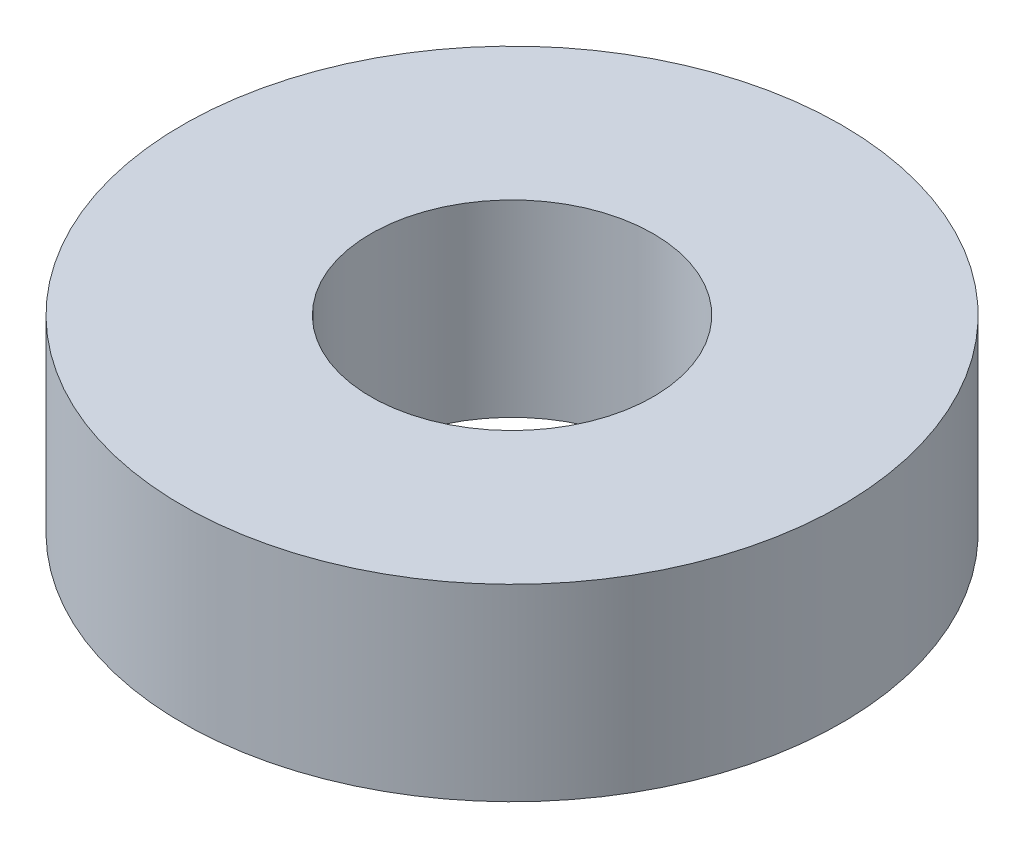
from build123d import *


with BuildPart() as part:
    # Sketch1 → Revolve1 (revolve)
    with BuildSketch(Plane.XY, mode=Mode.PRIVATE) as revolve1_sk:
        Polygon((-6, 3.937743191), (-14, 3.937743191), (-14, 0), (-14, -4.062256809), (-6, -4.062256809), align=None)
    revolve(revolve1_sk.sketch.rotate(Axis((0, 0, 0), (0, 1, 0)), 270), axis=Axis((0, 0, 0), (0, 1, 0)))


solid = part.part
